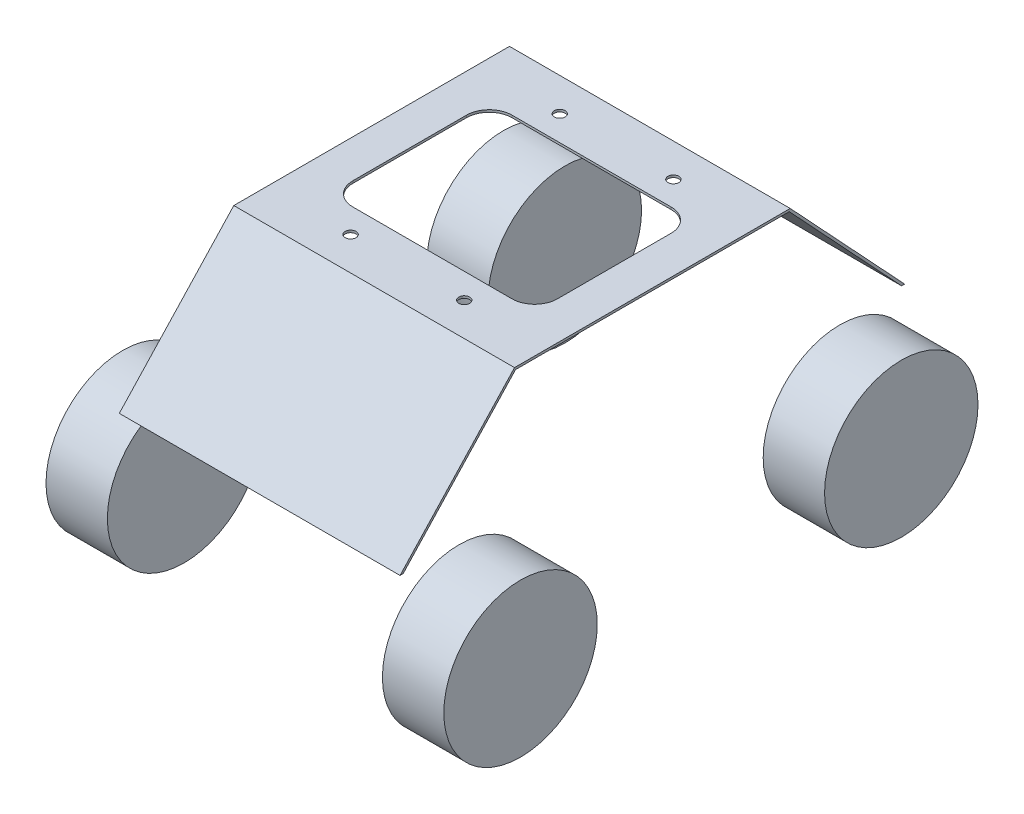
ISO-10303-21;
HEADER;
FILE_DESCRIPTION(('STEP AP214'),'2;1');
FILE_NAME('part.step','',(''),(''),'','','');
FILE_SCHEMA(('AUTOMOTIVE_DESIGN { 1 0 10303 214 1 1 1 1 }'));
ENDSEC;
DATA;
#1=APPLICATION_CONTEXT('core data for automotive mechanical design processes');
#2=APPLICATION_PROTOCOL_DEFINITION('international standard','automotive_design',2000,#1);
#3=PRODUCT_CONTEXT('',#1,'mechanical');
#4=PRODUCT('Part','Part','',(#3));
#5=PRODUCT_RELATED_PRODUCT_CATEGORY('part','',(#4));
#6=PRODUCT_DEFINITION_FORMATION('','',#4);
#7=PRODUCT_DEFINITION_CONTEXT('part definition',#1,'design');
#8=PRODUCT_DEFINITION('design','',#6,#7);
#9=PRODUCT_DEFINITION_SHAPE('','',#8);
#10=(LENGTH_UNIT() NAMED_UNIT(*) SI_UNIT(.MILLI.,.METRE.));
#11=(NAMED_UNIT(*) PLANE_ANGLE_UNIT() SI_UNIT($,.RADIAN.));
#12=(NAMED_UNIT(*) SI_UNIT($,.STERADIAN.) SOLID_ANGLE_UNIT());
#13=UNCERTAINTY_MEASURE_WITH_UNIT(LENGTH_MEASURE(1.E-05),#10,'distance_accuracy_value','');
#14=(GEOMETRIC_REPRESENTATION_CONTEXT(3) GLOBAL_UNCERTAINTY_ASSIGNED_CONTEXT((#13)) GLOBAL_UNIT_ASSIGNED_CONTEXT((#10,
#11,#12)) REPRESENTATION_CONTEXT('',''));
#15=CARTESIAN_POINT('',(0.,0.,0.));
#16=DIRECTION('',(0.,0.,1.));
#17=DIRECTION('',(1.,0.,0.));
#18=AXIS2_PLACEMENT_3D('',#15,#16,#17);
#19=CARTESIAN_POINT('',(0.,70.,0.));
#20=DIRECTION('',(0.,1.,0.));
#21=DIRECTION('',(0.,0.,1.));
#22=AXIS2_PLACEMENT_3D('',#19,#20,#21);
#23=PLANE('',#22);
#24=DIRECTION('',(0.,0.,1.));
#25=VECTOR('',#24,1.);
#26=CARTESIAN_POINT('',(-61.75,70.,-111.));
#27=LINE('',#26,#25);
#28=CARTESIAN_POINT('',(-61.75,70.,109.632672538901));
#29=VERTEX_POINT('',#28);
#30=CARTESIAN_POINT('',(-61.75,70.,111.));
#31=VERTEX_POINT('',#30);
#32=EDGE_CURVE('E254',#29,#31,#27,.T.);
#33=ORIENTED_EDGE('',*,*,#32,.F.);
#34=DIRECTION('',(1.,0.,0.));
#35=VECTOR('',#34,1.);
#36=CARTESIAN_POINT('',(0.,70.,109.632672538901));
#37=LINE('',#36,#35);
#38=CARTESIAN_POINT('',(61.75,70.,109.632672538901));
#39=VERTEX_POINT('',#38);
#40=EDGE_CURVE('E261',#29,#39,#37,.T.);
#41=ORIENTED_EDGE('',*,*,#40,.T.);
#42=DIRECTION('',(0.,0.,-1.));
#43=VECTOR('',#42,1.);
#44=CARTESIAN_POINT('',(61.75,70.,-111.));
#45=LINE('',#44,#43);
#46=CARTESIAN_POINT('',(61.75,70.,111.));
#47=VERTEX_POINT('',#46);
#48=EDGE_CURVE('E249',#47,#39,#45,.T.);
#49=ORIENTED_EDGE('',*,*,#48,.F.);
#50=DIRECTION('',(1.,0.,0.));
#51=VECTOR('',#50,1.);
#52=CARTESIAN_POINT('',(-61.75,70.,111.));
#53=LINE('',#52,#51);
#54=EDGE_CURVE('E246',#31,#47,#53,.T.);
#55=ORIENTED_EDGE('',*,*,#54,.F.);
#56=EDGE_LOOP('',(#33,#41,#49,#55));
#57=FACE_BOUND('',#56,.T.);
#58=ADVANCED_FACE('F43',(#57),#23,.F.);
#59=CARTESIAN_POINT('',(61.75,124.,-111.));
#60=DIRECTION('',(-1.,0.,0.));
#61=DIRECTION('',(0.,0.,1.));
#62=AXIS2_PLACEMENT_3D('',#59,#60,#61);
#63=PLANE('',#62);
#64=ORIENTED_EDGE('',*,*,#48,.T.);
#65=DIRECTION('',(0.,-0.731353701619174,0.681998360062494));
#66=VECTOR('',#65,1.);
#67=CARTESIAN_POINT('',(61.75,70.,109.632672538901));
#68=LINE('',#67,#66);
#69=CARTESIAN_POINT('',(61.75,123.,60.2093729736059));
#70=VERTEX_POINT('',#69);
#71=EDGE_CURVE('E213',#70,#39,#68,.T.);
#72=ORIENTED_EDGE('',*,*,#71,.F.);
#73=DIRECTION('',(0.,0.,1.));
#74=VECTOR('',#73,1.);
#75=CARTESIAN_POINT('',(61.75,123.,60.2093729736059));
#76=LINE('',#75,#74);
#77=CARTESIAN_POINT('',(61.75,123.,-60.2093729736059));
#78=VERTEX_POINT('',#77);
#79=EDGE_CURVE('E210',#78,#70,#76,.T.);
#80=ORIENTED_EDGE('',*,*,#79,.F.);
#81=DIRECTION('',(0.,0.731353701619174,0.681998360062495));
#82=VECTOR('',#81,1.);
#83=CARTESIAN_POINT('',(61.75,123.,-60.2093729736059));
#84=LINE('',#83,#82);
#85=CARTESIAN_POINT('',(61.75,70.,-109.632672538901));
#86=VERTEX_POINT('',#85);
#87=EDGE_CURVE('E197',#86,#78,#84,.T.);
#88=ORIENTED_EDGE('',*,*,#87,.F.);
#89=CARTESIAN_POINT('',(61.75,70.,-111.));
#90=VERTEX_POINT('',#89);
#91=EDGE_CURVE('E241',#86,#90,#45,.T.);
#92=ORIENTED_EDGE('',*,*,#91,.T.);
#93=DIRECTION('',(0.,-0.731353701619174,-0.681998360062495));
#94=VECTOR('',#93,1.);
#95=CARTESIAN_POINT('',(61.75,70.,-111.));
#96=LINE('',#95,#94);
#97=CARTESIAN_POINT('',(61.75,124.,-60.6441853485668));
#98=VERTEX_POINT('',#97);
#99=EDGE_CURVE('E225',#98,#90,#96,.T.);
#100=ORIENTED_EDGE('',*,*,#99,.F.);
#101=DIRECTION('',(0.,0.,-1.));
#102=VECTOR('',#101,1.);
#103=CARTESIAN_POINT('',(61.75,124.,-111.));
#104=LINE('',#103,#102);
#105=CARTESIAN_POINT('',(61.75,124.,60.6441853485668));
#106=VERTEX_POINT('',#105);
#107=EDGE_CURVE('E242',#106,#98,#104,.T.);
#108=ORIENTED_EDGE('',*,*,#107,.F.);
#109=DIRECTION('',(0.,0.731353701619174,-0.681998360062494));
#110=VECTOR('',#109,1.);
#111=CARTESIAN_POINT('',(61.75,124.,60.6441853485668));
#112=LINE('',#111,#110);
#113=EDGE_CURVE('E233',#47,#106,#112,.T.);
#114=ORIENTED_EDGE('',*,*,#113,.F.);
#115=EDGE_LOOP('',(#64,#72,#80,#88,#92,#100,#108,#114));
#116=FACE_BOUND('',#115,.T.);
#117=ADVANCED_FACE('F45',(#116),#63,.F.);
#118=CARTESIAN_POINT('',(-61.75,124.,-111.));
#119=DIRECTION('',(1.,0.,0.));
#120=DIRECTION('',(0.,0.,-1.));
#121=AXIS2_PLACEMENT_3D('',#118,#119,#120);
#122=PLANE('',#121);
#123=DIRECTION('',(0.,0.,1.));
#124=VECTOR('',#123,1.);
#125=CARTESIAN_POINT('',(-61.75,123.,-111.));
#126=LINE('',#125,#124);
#127=CARTESIAN_POINT('',(-61.75,123.,-60.2093729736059));
#128=VERTEX_POINT('',#127);
#129=CARTESIAN_POINT('',(-61.75,123.,60.2093729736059));
#130=VERTEX_POINT('',#129);
#131=EDGE_CURVE('E264',#128,#130,#126,.T.);
#132=ORIENTED_EDGE('',*,*,#131,.T.);
#133=DIRECTION('',(0.,-0.731353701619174,0.681998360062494));
#134=VECTOR('',#133,1.);
#135=CARTESIAN_POINT('',(-61.75,208.93103600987,-19.9226144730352));
#136=LINE('',#135,#134);
#137=EDGE_CURVE('E222',#130,#29,#136,.T.);
#138=ORIENTED_EDGE('',*,*,#137,.T.);
#139=ORIENTED_EDGE('',*,*,#32,.T.);
#140=DIRECTION('',(0.,0.731353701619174,-0.681998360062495));
#141=VECTOR('',#140,1.);
#142=CARTESIAN_POINT('',(-61.75,209.613034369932,-19.1912607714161));
#143=LINE('',#142,#141);
#144=CARTESIAN_POINT('',(-61.75,124.,60.6441853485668));
#145=VERTEX_POINT('',#144);
#146=EDGE_CURVE('E238',#31,#145,#143,.T.);
#147=ORIENTED_EDGE('',*,*,#146,.T.);
#148=DIRECTION('',(0.,0.,1.));
#149=VECTOR('',#148,1.);
#150=CARTESIAN_POINT('',(-61.75,124.,-111.));
#151=LINE('',#150,#149);
#152=CARTESIAN_POINT('',(-61.75,124.,-60.6441853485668));
#153=VERTEX_POINT('',#152);
#154=EDGE_CURVE('E245',#153,#145,#151,.T.);
#155=ORIENTED_EDGE('',*,*,#154,.F.);
#156=DIRECTION('',(0.,-0.731353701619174,-0.681998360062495));
#157=VECTOR('',#156,1.);
#158=CARTESIAN_POINT('',(-61.75,98.8834247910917,-84.0657706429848));
#159=LINE('',#158,#157);
#160=CARTESIAN_POINT('',(-61.75,70.,-111.));
#161=VERTEX_POINT('',#160);
#162=EDGE_CURVE('E230',#153,#161,#159,.T.);
#163=ORIENTED_EDGE('',*,*,#162,.T.);
#164=CARTESIAN_POINT('',(-61.75,70.,-109.632672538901));
#165=VERTEX_POINT('',#164);
#166=EDGE_CURVE('E255',#161,#165,#27,.T.);
#167=ORIENTED_EDGE('',*,*,#166,.T.);
#168=DIRECTION('',(0.,0.731353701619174,0.681998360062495));
#169=VECTOR('',#168,1.);
#170=CARTESIAN_POINT('',(-61.75,98.2014264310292,-83.3344169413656));
#171=LINE('',#170,#169);
#172=EDGE_CURVE('E218',#165,#128,#171,.T.);
#173=ORIENTED_EDGE('',*,*,#172,.T.);
#174=EDGE_LOOP('',(#132,#138,#139,#147,#155,#163,#167,#173));
#175=FACE_BOUND('',#174,.T.);
#176=ADVANCED_FACE('F314',(#175),#122,.F.);
#177=CARTESIAN_POINT('',(0.,124.,0.));
#178=DIRECTION('',(0.,1.,0.));
#179=DIRECTION('',(0.,0.,1.));
#180=AXIS2_PLACEMENT_3D('',#177,#178,#179);
#181=PLANE('',#180);
#182=CARTESIAN_POINT('',(25.,124.,-46.));
#183=DIRECTION('',(0.,1.,0.));
#184=DIRECTION('',(0.,0.,1.));
#185=AXIS2_PLACEMENT_3D('',#182,#183,#184);
#186=CIRCLE('',#185,2.4);
#187=CARTESIAN_POINT('',(25.,124.,-43.6));
#188=VERTEX_POINT('',#187);
#189=EDGE_CURVE('E303',#188,#188,#186,.T.);
#190=ORIENTED_EDGE('',*,*,#189,.F.);
#191=EDGE_LOOP('',(#190));
#192=FACE_BOUND('',#191,.T.);
#193=CARTESIAN_POINT('',(-25.,124.,-46.));
#194=DIRECTION('',(0.,1.,0.));
#195=DIRECTION('',(0.,0.,1.));
#196=AXIS2_PLACEMENT_3D('',#193,#194,#195);
#197=CIRCLE('',#196,2.4);
#198=CARTESIAN_POINT('',(-25.,124.,-43.6));
#199=VERTEX_POINT('',#198);
#200=EDGE_CURVE('E293',#199,#199,#197,.T.);
#201=ORIENTED_EDGE('',*,*,#200,.F.);
#202=EDGE_LOOP('',(#201));
#203=FACE_BOUND('',#202,.T.);
#204=CARTESIAN_POINT('',(25.,124.,46.));
#205=DIRECTION('',(0.,1.,0.));
#206=DIRECTION('',(0.,0.,1.));
#207=AXIS2_PLACEMENT_3D('',#204,#205,#206);
#208=CIRCLE('',#207,2.4);
#209=CARTESIAN_POINT('',(25.,124.,48.4));
#210=VERTEX_POINT('',#209);
#211=EDGE_CURVE('E290',#210,#210,#208,.T.);
#212=ORIENTED_EDGE('',*,*,#211,.F.);
#213=EDGE_LOOP('',(#212));
#214=FACE_BOUND('',#213,.T.);
#215=CARTESIAN_POINT('',(-25.,124.,46.));
#216=DIRECTION('',(0.,1.,0.));
#217=DIRECTION('',(0.,0.,1.));
#218=AXIS2_PLACEMENT_3D('',#215,#216,#217);
#219=CIRCLE('',#218,2.4);
#220=CARTESIAN_POINT('',(-25.,124.,48.4));
#221=VERTEX_POINT('',#220);
#222=EDGE_CURVE('E287',#221,#221,#219,.T.);
#223=ORIENTED_EDGE('',*,*,#222,.F.);
#224=EDGE_LOOP('',(#223));
#225=FACE_BOUND('',#224,.T.);
#226=CARTESIAN_POINT('',(35.,124.,25.));
#227=DIRECTION('',(0.,1.,0.));
#228=DIRECTION('',(0.,0.,1.));
#229=AXIS2_PLACEMENT_3D('',#226,#227,#228);
#230=CIRCLE('',#229,10.);
#231=CARTESIAN_POINT('',(34.9999999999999,124.,35.));
#232=VERTEX_POINT('',#231);
#233=CARTESIAN_POINT('',(45.,124.,24.9999999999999));
#234=VERTEX_POINT('',#233);
#235=EDGE_CURVE('E60',#232,#234,#230,.T.);
#236=ORIENTED_EDGE('',*,*,#235,.F.);
#237=DIRECTION('',(1.,0.,0.));
#238=VECTOR('',#237,1.);
#239=CARTESIAN_POINT('',(-34.9999999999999,124.,35.));
#240=LINE('',#239,#238);
#241=CARTESIAN_POINT('',(-34.9999999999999,124.,35.));
#242=VERTEX_POINT('',#241);
#243=EDGE_CURVE('E192',#242,#232,#240,.T.);
#244=ORIENTED_EDGE('',*,*,#243,.F.);
#245=CARTESIAN_POINT('',(-35.,124.,25.));
#246=DIRECTION('',(0.,1.,0.));
#247=DIRECTION('',(0.,0.,1.));
#248=AXIS2_PLACEMENT_3D('',#245,#246,#247);
#249=CIRCLE('',#248,10.);
#250=CARTESIAN_POINT('',(-45.,124.,24.9999999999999));
#251=VERTEX_POINT('',#250);
#252=EDGE_CURVE('E189',#251,#242,#249,.T.);
#253=ORIENTED_EDGE('',*,*,#252,.F.);
#254=DIRECTION('',(0.,0.,1.));
#255=VECTOR('',#254,1.);
#256=CARTESIAN_POINT('',(-45.,124.,-24.9999999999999));
#257=LINE('',#256,#255);
#258=CARTESIAN_POINT('',(-45.,124.,-24.9999999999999));
#259=VERTEX_POINT('',#258);
#260=EDGE_CURVE('E186',#259,#251,#257,.T.);
#261=ORIENTED_EDGE('',*,*,#260,.F.);
#262=CARTESIAN_POINT('',(-35.,124.,-25.));
#263=DIRECTION('',(0.,1.,0.));
#264=DIRECTION('',(0.,0.,1.));
#265=AXIS2_PLACEMENT_3D('',#262,#263,#264);
#266=CIRCLE('',#265,10.);
#267=CARTESIAN_POINT('',(-34.9999999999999,124.,-35.));
#268=VERTEX_POINT('',#267);
#269=EDGE_CURVE('E180',#268,#259,#266,.T.);
#270=ORIENTED_EDGE('',*,*,#269,.F.);
#271=DIRECTION('',(-1.,0.,0.));
#272=VECTOR('',#271,1.);
#273=CARTESIAN_POINT('',(-34.9999999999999,124.,-35.));
#274=LINE('',#273,#272);
#275=CARTESIAN_POINT('',(34.9999999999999,124.,-35.));
#276=VERTEX_POINT('',#275);
#277=EDGE_CURVE('E178',#276,#268,#274,.T.);
#278=ORIENTED_EDGE('',*,*,#277,.F.);
#279=CARTESIAN_POINT('',(35.,124.,-25.));
#280=DIRECTION('',(0.,1.,0.));
#281=DIRECTION('',(0.,0.,-1.));
#282=AXIS2_PLACEMENT_3D('',#279,#280,#281);
#283=CIRCLE('',#282,10.);
#284=CARTESIAN_POINT('',(45.,124.,-24.9999999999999));
#285=VERTEX_POINT('',#284);
#286=EDGE_CURVE('E161',#285,#276,#283,.T.);
#287=ORIENTED_EDGE('',*,*,#286,.F.);
#288=DIRECTION('',(0.,0.,-1.));
#289=VECTOR('',#288,1.);
#290=CARTESIAN_POINT('',(45.,124.,-24.9999999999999));
#291=LINE('',#290,#289);
#292=EDGE_CURVE('E170',#234,#285,#291,.T.);
#293=ORIENTED_EDGE('',*,*,#292,.F.);
#294=EDGE_LOOP('',(#236,#244,#253,#261,#270,#278,#287,#293));
#295=FACE_BOUND('',#294,.T.);
#296=DIRECTION('',(1.,0.,0.));
#297=VECTOR('',#296,1.);
#298=CARTESIAN_POINT('',(-87.5,124.,-60.6441853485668));
#299=LINE('',#298,#297);
#300=EDGE_CURVE('E228',#153,#98,#299,.T.);
#301=ORIENTED_EDGE('',*,*,#300,.F.);
#302=ORIENTED_EDGE('',*,*,#154,.T.);
#303=DIRECTION('',(1.,0.,0.));
#304=VECTOR('',#303,1.);
#305=CARTESIAN_POINT('',(-87.5,124.,60.6441853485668));
#306=LINE('',#305,#304);
#307=EDGE_CURVE('E235',#145,#106,#306,.T.);
#308=ORIENTED_EDGE('',*,*,#307,.T.);
#309=ORIENTED_EDGE('',*,*,#107,.T.);
#310=EDGE_LOOP('',(#301,#302,#308,#309));
#311=FACE_BOUND('',#310,.T.);
#312=ADVANCED_FACE('F174',(#192,#203,#214,#225,#295,#311),#181,.T.);
#313=ORIENTED_EDGE('',*,*,#91,.F.);
#314=DIRECTION('',(-1.,0.,0.));
#315=VECTOR('',#314,1.);
#316=CARTESIAN_POINT('',(0.,70.,-109.632672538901));
#317=LINE('',#316,#315);
#318=EDGE_CURVE('E248',#86,#165,#317,.T.);
#319=ORIENTED_EDGE('',*,*,#318,.T.);
#320=ORIENTED_EDGE('',*,*,#166,.F.);
#321=DIRECTION('',(-1.,0.,0.));
#322=VECTOR('',#321,1.);
#323=CARTESIAN_POINT('',(-61.75,70.,-111.));
#324=LINE('',#323,#322);
#325=EDGE_CURVE('E252',#90,#161,#324,.T.);
#326=ORIENTED_EDGE('',*,*,#325,.F.);
#327=EDGE_LOOP('',(#313,#319,#320,#326));
#328=FACE_BOUND('',#327,.T.);
#329=ADVANCED_FACE('F313',(#328),#23,.F.);
#330=CARTESIAN_POINT('',(-87.5,124.,60.6441853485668));
#331=DIRECTION('',(0.,-0.681998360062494,-0.731353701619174));
#332=DIRECTION('',(0.,0.731353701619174,-0.681998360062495));
#333=AXIS2_PLACEMENT_3D('',#330,#331,#332);
#334=PLANE('',#333);
#335=ORIENTED_EDGE('',*,*,#54,.T.);
#336=ORIENTED_EDGE('',*,*,#113,.T.);
#337=ORIENTED_EDGE('',*,*,#307,.F.);
#338=ORIENTED_EDGE('',*,*,#146,.F.);
#339=EDGE_LOOP('',(#335,#336,#337,#338));
#340=FACE_BOUND('',#339,.T.);
#341=ADVANCED_FACE('F321',(#340),#334,.F.);
#342=CARTESIAN_POINT('',(-87.5,70.,-111.));
#343=DIRECTION('',(0.,-0.681998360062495,0.731353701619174));
#344=DIRECTION('',(0.,-0.731353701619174,-0.681998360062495));
#345=AXIS2_PLACEMENT_3D('',#342,#343,#344);
#346=PLANE('',#345);
#347=ORIENTED_EDGE('',*,*,#300,.T.);
#348=ORIENTED_EDGE('',*,*,#99,.T.);
#349=ORIENTED_EDGE('',*,*,#325,.T.);
#350=ORIENTED_EDGE('',*,*,#162,.F.);
#351=EDGE_LOOP('',(#347,#348,#349,#350));
#352=FACE_BOUND('',#351,.T.);
#353=ADVANCED_FACE('F349',(#352),#346,.F.);
#354=CARTESIAN_POINT('',(-87.5,123.,60.2093729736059));
#355=DIRECTION('',(0.,1.,0.));
#356=DIRECTION('',(0.,0.,1.));
#357=AXIS2_PLACEMENT_3D('',#354,#355,#356);
#358=PLANE('',#357);
#359=CARTESIAN_POINT('',(25.,123.,-46.));
#360=DIRECTION('',(0.,1.,0.));
#361=DIRECTION('',(0.,0.,1.));
#362=AXIS2_PLACEMENT_3D('',#359,#360,#361);
#363=CIRCLE('',#362,2.4);
#364=CARTESIAN_POINT('',(25.,123.,-43.6));
#365=VERTEX_POINT('',#364);
#366=EDGE_CURVE('E47',#365,#365,#363,.T.);
#367=ORIENTED_EDGE('',*,*,#366,.T.);
#368=EDGE_LOOP('',(#367));
#369=FACE_BOUND('',#368,.T.);
#370=CARTESIAN_POINT('',(-25.,123.,-46.));
#371=DIRECTION('',(0.,1.,0.));
#372=DIRECTION('',(0.,0.,1.));
#373=AXIS2_PLACEMENT_3D('',#370,#371,#372);
#374=CIRCLE('',#373,2.4);
#375=CARTESIAN_POINT('',(-25.,123.,-43.6));
#376=VERTEX_POINT('',#375);
#377=EDGE_CURVE('E291',#376,#376,#374,.T.);
#378=ORIENTED_EDGE('',*,*,#377,.T.);
#379=EDGE_LOOP('',(#378));
#380=FACE_BOUND('',#379,.T.);
#381=CARTESIAN_POINT('',(25.,123.,46.));
#382=DIRECTION('',(0.,1.,0.));
#383=DIRECTION('',(0.,0.,1.));
#384=AXIS2_PLACEMENT_3D('',#381,#382,#383);
#385=CIRCLE('',#384,2.4);
#386=CARTESIAN_POINT('',(25.,123.,48.4));
#387=VERTEX_POINT('',#386);
#388=EDGE_CURVE('E288',#387,#387,#385,.T.);
#389=ORIENTED_EDGE('',*,*,#388,.T.);
#390=EDGE_LOOP('',(#389));
#391=FACE_BOUND('',#390,.T.);
#392=CARTESIAN_POINT('',(-25.,123.,46.));
#393=DIRECTION('',(0.,1.,0.));
#394=DIRECTION('',(0.,0.,1.));
#395=AXIS2_PLACEMENT_3D('',#392,#393,#394);
#396=CIRCLE('',#395,2.4);
#397=CARTESIAN_POINT('',(-25.,123.,48.4));
#398=VERTEX_POINT('',#397);
#399=EDGE_CURVE('E284',#398,#398,#396,.T.);
#400=ORIENTED_EDGE('',*,*,#399,.T.);
#401=EDGE_LOOP('',(#400));
#402=FACE_BOUND('',#401,.T.);
#403=DIRECTION('',(1.,0.,0.));
#404=VECTOR('',#403,1.);
#405=CARTESIAN_POINT('',(-87.5,123.,35.));
#406=LINE('',#405,#404);
#407=CARTESIAN_POINT('',(-34.9999999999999,123.,35.));
#408=VERTEX_POINT('',#407);
#409=CARTESIAN_POINT('',(34.9999999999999,123.,35.));
#410=VERTEX_POINT('',#409);
#411=EDGE_CURVE('E52',#408,#410,#406,.T.);
#412=ORIENTED_EDGE('',*,*,#411,.T.);
#413=CARTESIAN_POINT('',(35.,123.,25.));
#414=DIRECTION('',(0.,1.,0.));
#415=DIRECTION('',(0.,0.,1.));
#416=AXIS2_PLACEMENT_3D('',#413,#414,#415);
#417=CIRCLE('',#416,10.);
#418=CARTESIAN_POINT('',(45.,123.,24.9999999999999));
#419=VERTEX_POINT('',#418);
#420=EDGE_CURVE('E12',#410,#419,#417,.T.);
#421=ORIENTED_EDGE('',*,*,#420,.T.);
#422=DIRECTION('',(0.,0.,-1.));
#423=VECTOR('',#422,1.);
#424=CARTESIAN_POINT('',(45.,123.,60.2093729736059));
#425=LINE('',#424,#423);
#426=CARTESIAN_POINT('',(45.,123.,-24.9999999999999));
#427=VERTEX_POINT('',#426);
#428=EDGE_CURVE('E267',#419,#427,#425,.T.);
#429=ORIENTED_EDGE('',*,*,#428,.T.);
#430=CARTESIAN_POINT('',(35.,123.,-25.));
#431=DIRECTION('',(0.,1.,0.));
#432=DIRECTION('',(0.,0.,1.));
#433=AXIS2_PLACEMENT_3D('',#430,#431,#432);
#434=CIRCLE('',#433,10.);
#435=CARTESIAN_POINT('',(34.9999999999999,123.,-35.));
#436=VERTEX_POINT('',#435);
#437=EDGE_CURVE('E164',#427,#436,#434,.T.);
#438=ORIENTED_EDGE('',*,*,#437,.T.);
#439=DIRECTION('',(-1.,0.,0.));
#440=VECTOR('',#439,1.);
#441=CARTESIAN_POINT('',(-87.5,123.,-35.));
#442=LINE('',#441,#440);
#443=CARTESIAN_POINT('',(-34.9999999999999,123.,-35.));
#444=VERTEX_POINT('',#443);
#445=EDGE_CURVE('E270',#436,#444,#442,.T.);
#446=ORIENTED_EDGE('',*,*,#445,.T.);
#447=CARTESIAN_POINT('',(-35.,123.,-25.));
#448=DIRECTION('',(0.,1.,0.));
#449=DIRECTION('',(0.,0.,1.));
#450=AXIS2_PLACEMENT_3D('',#447,#448,#449);
#451=CIRCLE('',#450,10.);
#452=CARTESIAN_POINT('',(-45.,123.,-24.9999999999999));
#453=VERTEX_POINT('',#452);
#454=EDGE_CURVE('E273',#444,#453,#451,.T.);
#455=ORIENTED_EDGE('',*,*,#454,.T.);
#456=DIRECTION('',(0.,0.,1.));
#457=VECTOR('',#456,1.);
#458=CARTESIAN_POINT('',(-45.,123.,60.2093729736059));
#459=LINE('',#458,#457);
#460=CARTESIAN_POINT('',(-45.,123.,24.9999999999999));
#461=VERTEX_POINT('',#460);
#462=EDGE_CURVE('E276',#453,#461,#459,.T.);
#463=ORIENTED_EDGE('',*,*,#462,.T.);
#464=CARTESIAN_POINT('',(-35.,123.,25.));
#465=DIRECTION('',(0.,1.,0.));
#466=DIRECTION('',(0.,0.,1.));
#467=AXIS2_PLACEMENT_3D('',#464,#465,#466);
#468=CIRCLE('',#467,10.);
#469=EDGE_CURVE('E279',#461,#408,#468,.T.);
#470=ORIENTED_EDGE('',*,*,#469,.T.);
#471=EDGE_LOOP('',(#412,#421,#429,#438,#446,#455,#463,#470));
#472=FACE_BOUND('',#471,.T.);
#473=DIRECTION('',(1.,0.,0.));
#474=VECTOR('',#473,1.);
#475=CARTESIAN_POINT('',(-87.5,123.,-60.2093729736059));
#476=LINE('',#475,#474);
#477=EDGE_CURVE('E215',#128,#78,#476,.T.);
#478=ORIENTED_EDGE('',*,*,#477,.T.);
#479=ORIENTED_EDGE('',*,*,#79,.T.);
#480=DIRECTION('',(1.,0.,0.));
#481=VECTOR('',#480,1.);
#482=CARTESIAN_POINT('',(-87.5,123.,60.2093729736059));
#483=LINE('',#482,#481);
#484=EDGE_CURVE('E216',#130,#70,#483,.T.);
#485=ORIENTED_EDGE('',*,*,#484,.F.);
#486=ORIENTED_EDGE('',*,*,#131,.F.);
#487=EDGE_LOOP('',(#478,#479,#485,#486));
#488=FACE_BOUND('',#487,.T.);
#489=ADVANCED_FACE('F356',(#369,#380,#391,#402,#472,#488),#358,.F.);
#490=CARTESIAN_POINT('',(-87.5,70.,109.632672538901));
#491=DIRECTION('',(0.,0.681998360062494,0.731353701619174));
#492=DIRECTION('',(0.,-0.731353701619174,0.681998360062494));
#493=AXIS2_PLACEMENT_3D('',#490,#491,#492);
#494=PLANE('',#493);
#495=ORIENTED_EDGE('',*,*,#484,.T.);
#496=ORIENTED_EDGE('',*,*,#71,.T.);
#497=ORIENTED_EDGE('',*,*,#40,.F.);
#498=ORIENTED_EDGE('',*,*,#137,.F.);
#499=EDGE_LOOP('',(#495,#496,#497,#498));
#500=FACE_BOUND('',#499,.T.);
#501=ADVANCED_FACE('F360',(#500),#494,.F.);
#502=CARTESIAN_POINT('',(-87.5,123.,-60.2093729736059));
#503=DIRECTION('',(0.,0.681998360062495,-0.731353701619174));
#504=DIRECTION('',(0.,0.731353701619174,0.681998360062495));
#505=AXIS2_PLACEMENT_3D('',#502,#503,#504);
#506=PLANE('',#505);
#507=ORIENTED_EDGE('',*,*,#318,.F.);
#508=ORIENTED_EDGE('',*,*,#87,.T.);
#509=ORIENTED_EDGE('',*,*,#477,.F.);
#510=ORIENTED_EDGE('',*,*,#172,.F.);
#511=EDGE_LOOP('',(#507,#508,#509,#510));
#512=FACE_BOUND('',#511,.T.);
#513=ADVANCED_FACE('F353',(#512),#506,.F.);
#514=CARTESIAN_POINT('',(35.,0.,25.));
#515=DIRECTION('',(0.,1.,0.));
#516=DIRECTION('',(0.,0.,1.));
#517=AXIS2_PLACEMENT_3D('',#514,#515,#516);
#518=CYLINDRICAL_SURFACE('',#517,10.);
#519=DIRECTION('',(0.,1.,0.));
#520=VECTOR('',#519,1.);
#521=CARTESIAN_POINT('',(34.9999999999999,0.,35.));
#522=LINE('',#521,#520);
#523=EDGE_CURVE('E195',#410,#232,#522,.T.);
#524=ORIENTED_EDGE('',*,*,#523,.T.);
#525=ORIENTED_EDGE('',*,*,#235,.T.);
#526=DIRECTION('',(0.,1.,0.));
#527=VECTOR('',#526,1.);
#528=CARTESIAN_POINT('',(45.,0.,24.9999999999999));
#529=LINE('',#528,#527);
#530=EDGE_CURVE('E167',#419,#234,#529,.T.);
#531=ORIENTED_EDGE('',*,*,#530,.F.);
#532=ORIENTED_EDGE('',*,*,#420,.F.);
#533=EDGE_LOOP('',(#524,#525,#531,#532));
#534=FACE_BOUND('',#533,.T.);
#535=ADVANCED_FACE('F367',(#534),#518,.F.);
#536=CARTESIAN_POINT('',(-34.9999999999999,0.,35.));
#537=DIRECTION('',(0.,0.,1.));
#538=DIRECTION('',(1.,0.,0.));
#539=AXIS2_PLACEMENT_3D('',#536,#537,#538);
#540=PLANE('',#539);
#541=DIRECTION('',(0.,1.,0.));
#542=VECTOR('',#541,1.);
#543=CARTESIAN_POINT('',(-34.9999999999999,0.,35.));
#544=LINE('',#543,#542);
#545=EDGE_CURVE('E198',#408,#242,#544,.T.);
#546=ORIENTED_EDGE('',*,*,#545,.T.);
#547=ORIENTED_EDGE('',*,*,#243,.T.);
#548=ORIENTED_EDGE('',*,*,#523,.F.);
#549=ORIENTED_EDGE('',*,*,#411,.F.);
#550=EDGE_LOOP('',(#546,#547,#548,#549));
#551=FACE_BOUND('',#550,.T.);
#552=ADVANCED_FACE('F401',(#551),#540,.F.);
#553=CARTESIAN_POINT('',(-35.,0.,25.));
#554=DIRECTION('',(0.,1.,0.));
#555=DIRECTION('',(0.,0.,1.));
#556=AXIS2_PLACEMENT_3D('',#553,#554,#555);
#557=CYLINDRICAL_SURFACE('',#556,10.);
#558=DIRECTION('',(0.,1.,0.));
#559=VECTOR('',#558,1.);
#560=CARTESIAN_POINT('',(-45.,0.,24.9999999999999));
#561=LINE('',#560,#559);
#562=EDGE_CURVE('E200',#461,#251,#561,.T.);
#563=ORIENTED_EDGE('',*,*,#562,.T.);
#564=ORIENTED_EDGE('',*,*,#252,.T.);
#565=ORIENTED_EDGE('',*,*,#545,.F.);
#566=ORIENTED_EDGE('',*,*,#469,.F.);
#567=EDGE_LOOP('',(#563,#564,#565,#566));
#568=FACE_BOUND('',#567,.T.);
#569=ADVANCED_FACE('F410',(#568),#557,.F.);
#570=CARTESIAN_POINT('',(-45.,0.,-24.9999999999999));
#571=DIRECTION('',(-1.,0.,0.));
#572=DIRECTION('',(0.,0.,1.));
#573=AXIS2_PLACEMENT_3D('',#570,#571,#572);
#574=PLANE('',#573);
#575=DIRECTION('',(0.,1.,0.));
#576=VECTOR('',#575,1.);
#577=CARTESIAN_POINT('',(-45.,0.,-24.9999999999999));
#578=LINE('',#577,#576);
#579=EDGE_CURVE('E202',#453,#259,#578,.T.);
#580=ORIENTED_EDGE('',*,*,#579,.T.);
#581=ORIENTED_EDGE('',*,*,#260,.T.);
#582=ORIENTED_EDGE('',*,*,#562,.F.);
#583=ORIENTED_EDGE('',*,*,#462,.F.);
#584=EDGE_LOOP('',(#580,#581,#582,#583));
#585=FACE_BOUND('',#584,.T.);
#586=ADVANCED_FACE('F420',(#585),#574,.F.);
#587=CARTESIAN_POINT('',(-35.,0.,-25.));
#588=DIRECTION('',(0.,1.,0.));
#589=DIRECTION('',(0.,0.,1.));
#590=AXIS2_PLACEMENT_3D('',#587,#588,#589);
#591=CYLINDRICAL_SURFACE('',#590,10.);
#592=DIRECTION('',(0.,1.,0.));
#593=VECTOR('',#592,1.);
#594=CARTESIAN_POINT('',(-34.9999999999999,0.,-35.));
#595=LINE('',#594,#593);
#596=EDGE_CURVE('E204',#444,#268,#595,.T.);
#597=ORIENTED_EDGE('',*,*,#596,.T.);
#598=ORIENTED_EDGE('',*,*,#269,.T.);
#599=ORIENTED_EDGE('',*,*,#579,.F.);
#600=ORIENTED_EDGE('',*,*,#454,.F.);
#601=EDGE_LOOP('',(#597,#598,#599,#600));
#602=FACE_BOUND('',#601,.T.);
#603=ADVANCED_FACE('F430',(#602),#591,.F.);
#604=CARTESIAN_POINT('',(-34.9999999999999,0.,-35.));
#605=DIRECTION('',(0.,0.,-1.));
#606=DIRECTION('',(-1.,0.,0.));
#607=AXIS2_PLACEMENT_3D('',#604,#605,#606);
#608=PLANE('',#607);
#609=DIRECTION('',(0.,1.,0.));
#610=VECTOR('',#609,1.);
#611=CARTESIAN_POINT('',(34.9999999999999,0.,-35.));
#612=LINE('',#611,#610);
#613=EDGE_CURVE('E166',#436,#276,#612,.T.);
#614=ORIENTED_EDGE('',*,*,#613,.T.);
#615=ORIENTED_EDGE('',*,*,#277,.T.);
#616=ORIENTED_EDGE('',*,*,#596,.F.);
#617=ORIENTED_EDGE('',*,*,#445,.F.);
#618=EDGE_LOOP('',(#614,#615,#616,#617));
#619=FACE_BOUND('',#618,.T.);
#620=ADVANCED_FACE('F440',(#619),#608,.F.);
#621=CARTESIAN_POINT('',(35.,0.,-25.));
#622=DIRECTION('',(0.,1.,0.));
#623=DIRECTION('',(0.,0.,1.));
#624=AXIS2_PLACEMENT_3D('',#621,#622,#623);
#625=CYLINDRICAL_SURFACE('',#624,10.);
#626=DIRECTION('',(0.,1.,0.));
#627=VECTOR('',#626,1.);
#628=CARTESIAN_POINT('',(45.,0.,-24.9999999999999));
#629=LINE('',#628,#627);
#630=EDGE_CURVE('E68',#427,#285,#629,.T.);
#631=ORIENTED_EDGE('',*,*,#630,.T.);
#632=ORIENTED_EDGE('',*,*,#286,.T.);
#633=ORIENTED_EDGE('',*,*,#613,.F.);
#634=ORIENTED_EDGE('',*,*,#437,.F.);
#635=EDGE_LOOP('',(#631,#632,#633,#634));
#636=FACE_BOUND('',#635,.T.);
#637=ADVANCED_FACE('F158',(#636),#625,.F.);
#638=CARTESIAN_POINT('',(45.,0.,-24.9999999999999));
#639=DIRECTION('',(1.,0.,0.));
#640=DIRECTION('',(0.,0.,-1.));
#641=AXIS2_PLACEMENT_3D('',#638,#639,#640);
#642=PLANE('',#641);
#643=ORIENTED_EDGE('',*,*,#530,.T.);
#644=ORIENTED_EDGE('',*,*,#292,.T.);
#645=ORIENTED_EDGE('',*,*,#630,.F.);
#646=ORIENTED_EDGE('',*,*,#428,.F.);
#647=EDGE_LOOP('',(#643,#644,#645,#646));
#648=FACE_BOUND('',#647,.T.);
#649=ADVANCED_FACE('F171',(#648),#642,.F.);
#650=CARTESIAN_POINT('',(-25.,0.,46.));
#651=DIRECTION('',(0.,1.,0.));
#652=DIRECTION('',(0.,0.,1.));
#653=AXIS2_PLACEMENT_3D('',#650,#651,#652);
#654=CYLINDRICAL_SURFACE('',#653,2.4);
#655=ORIENTED_EDGE('',*,*,#222,.T.);
#656=EDGE_LOOP('',(#655));
#657=FACE_BOUND('',#656,.T.);
#658=ORIENTED_EDGE('',*,*,#399,.F.);
#659=EDGE_LOOP('',(#658));
#660=FACE_BOUND('',#659,.T.);
#661=ADVANCED_FACE('F309',(#657,#660),#654,.F.);
#662=CARTESIAN_POINT('',(25.,0.,46.));
#663=DIRECTION('',(0.,1.,0.));
#664=DIRECTION('',(0.,0.,1.));
#665=AXIS2_PLACEMENT_3D('',#662,#663,#664);
#666=CYLINDRICAL_SURFACE('',#665,2.4);
#667=ORIENTED_EDGE('',*,*,#211,.T.);
#668=EDGE_LOOP('',(#667));
#669=FACE_BOUND('',#668,.T.);
#670=ORIENTED_EDGE('',*,*,#388,.F.);
#671=EDGE_LOOP('',(#670));
#672=FACE_BOUND('',#671,.T.);
#673=ADVANCED_FACE('F474',(#669,#672),#666,.F.);
#674=CARTESIAN_POINT('',(-25.,0.,-46.));
#675=DIRECTION('',(0.,1.,0.));
#676=DIRECTION('',(0.,0.,1.));
#677=AXIS2_PLACEMENT_3D('',#674,#675,#676);
#678=CYLINDRICAL_SURFACE('',#677,2.4);
#679=ORIENTED_EDGE('',*,*,#200,.T.);
#680=EDGE_LOOP('',(#679));
#681=FACE_BOUND('',#680,.T.);
#682=ORIENTED_EDGE('',*,*,#377,.F.);
#683=EDGE_LOOP('',(#682));
#684=FACE_BOUND('',#683,.T.);
#685=ADVANCED_FACE('F483',(#681,#684),#678,.F.);
#686=CARTESIAN_POINT('',(25.,0.,-46.));
#687=DIRECTION('',(0.,1.,0.));
#688=DIRECTION('',(0.,0.,1.));
#689=AXIS2_PLACEMENT_3D('',#686,#687,#688);
#690=CYLINDRICAL_SURFACE('',#689,2.4);
#691=ORIENTED_EDGE('',*,*,#189,.T.);
#692=EDGE_LOOP('',(#691));
#693=FACE_BOUND('',#692,.T.);
#694=ORIENTED_EDGE('',*,*,#366,.F.);
#695=EDGE_LOOP('',(#694));
#696=FACE_BOUND('',#695,.T.);
#697=ADVANCED_FACE('F493',(#693,#696),#690,.F.);
#698=CLOSED_SHELL('',(#58,#117,#176,#312,#329,#341,#353,#489,#501,#513,#535,#552,#569,#586,#603,
#620,#637,#649,#661,#673,#685,#697));
#699=MANIFOLD_SOLID_BREP('B2',#698);
#700=CARTESIAN_POINT('',(87.5,67.5,-117.5));
#701=DIRECTION('',(-1.,0.,0.));
#702=DIRECTION('',(0.,0.,1.));
#703=AXIS2_PLACEMENT_3D('',#700,#701,#702);
#704=PLANE('',#703);
#705=CARTESIAN_POINT('',(87.5,33.75,83.75));
#706=DIRECTION('',(-1.,0.,0.));
#707=DIRECTION('',(0.,0.,1.));
#708=AXIS2_PLACEMENT_3D('',#705,#706,#707);
#709=CIRCLE('',#708,33.75);
#710=CARTESIAN_POINT('',(87.5,33.75,117.5));
#711=VERTEX_POINT('',#710);
#712=EDGE_CURVE('E589',#711,#711,#709,.F.);
#713=ORIENTED_EDGE('',*,*,#712,.T.);
#714=EDGE_LOOP('',(#713));
#715=FACE_BOUND('',#714,.T.);
#716=ADVANCED_FACE('F571',(#715),#704,.F.);
#717=CARTESIAN_POINT('',(0.,33.75,83.75));
#718=DIRECTION('',(-1.,0.,0.));
#719=DIRECTION('',(0.,0.,1.));
#720=AXIS2_PLACEMENT_3D('',#717,#718,#719);
#721=CYLINDRICAL_SURFACE('',#720,33.75);
#722=CARTESIAN_POINT('',(60.5,33.75,83.75));
#723=DIRECTION('',(1.,0.,0.));
#724=DIRECTION('',(0.,0.,-1.));
#725=AXIS2_PLACEMENT_3D('',#722,#723,#724);
#726=CIRCLE('',#725,33.75);
#727=CARTESIAN_POINT('',(60.5,33.75,117.5));
#728=VERTEX_POINT('',#727);
#729=EDGE_CURVE('E41',#728,#728,#726,.F.);
#730=ORIENTED_EDGE('',*,*,#729,.F.);
#731=DIRECTION('',(1.,0.,0.));
#732=VECTOR('',#731,1.);
#733=CARTESIAN_POINT('',(-87.5,33.75,117.5));
#734=LINE('',#733,#732);
#735=EDGE_CURVE('E575',#711,#728,#734,.F.);
#736=ORIENTED_EDGE('',*,*,#735,.F.);
#737=ORIENTED_EDGE('',*,*,#712,.F.);
#738=ORIENTED_EDGE('',*,*,#735,.T.);
#739=EDGE_LOOP('',(#730,#736,#737,#738));
#740=FACE_BOUND('',#739,.T.);
#741=ADVANCED_FACE('F573',(#740),#721,.T.);
#742=CARTESIAN_POINT('',(60.5,67.5,-117.5));
#743=DIRECTION('',(1.,0.,0.));
#744=DIRECTION('',(0.,0.,-1.));
#745=AXIS2_PLACEMENT_3D('',#742,#743,#744);
#746=PLANE('',#745);
#747=ORIENTED_EDGE('',*,*,#729,.T.);
#748=EDGE_LOOP('',(#747));
#749=FACE_BOUND('',#748,.T.);
#750=ADVANCED_FACE('F591',(#749),#746,.F.);
#751=CLOSED_SHELL('',(#716,#741,#750));
#752=MANIFOLD_SOLID_BREP('B6',#751);
#753=CARTESIAN_POINT('',(0.,33.75,-83.75));
#754=DIRECTION('',(1.,0.,0.));
#755=DIRECTION('',(0.,0.,-1.));
#756=AXIS2_PLACEMENT_3D('',#753,#754,#755);
#757=CYLINDRICAL_SURFACE('',#756,33.75);
#758=DIRECTION('',(-1.,0.,0.));
#759=VECTOR('',#758,1.);
#760=CARTESIAN_POINT('',(87.5,33.75,-117.5));
#761=LINE('',#760,#759);
#762=CARTESIAN_POINT('',(60.5,33.75,-117.5));
#763=VERTEX_POINT('',#762);
#764=CARTESIAN_POINT('',(87.5,33.75,-117.5));
#765=VERTEX_POINT('',#764);
#766=EDGE_CURVE('E635',#763,#765,#761,.F.);
#767=ORIENTED_EDGE('',*,*,#766,.F.);
#768=CARTESIAN_POINT('',(60.5,33.75,-83.75));
#769=DIRECTION('',(1.,0.,0.));
#770=DIRECTION('',(0.,0.,-1.));
#771=AXIS2_PLACEMENT_3D('',#768,#769,#770);
#772=CIRCLE('',#771,33.75);
#773=EDGE_CURVE('E569',#763,#763,#772,.F.);
#774=ORIENTED_EDGE('',*,*,#773,.F.);
#775=ORIENTED_EDGE('',*,*,#766,.T.);
#776=CARTESIAN_POINT('',(87.5,33.75,-83.75));
#777=DIRECTION('',(-1.,0.,0.));
#778=DIRECTION('',(0.,0.,1.));
#779=AXIS2_PLACEMENT_3D('',#776,#777,#778);
#780=CIRCLE('',#779,33.75);
#781=EDGE_CURVE('E640',#765,#765,#780,.F.);
#782=ORIENTED_EDGE('',*,*,#781,.F.);
#783=EDGE_LOOP('',(#767,#774,#775,#782));
#784=FACE_BOUND('',#783,.T.);
#785=ADVANCED_FACE('F632',(#784),#757,.T.);
#786=CARTESIAN_POINT('',(87.5,67.5,-117.5));
#787=DIRECTION('',(-1.,0.,0.));
#788=DIRECTION('',(0.,0.,1.));
#789=AXIS2_PLACEMENT_3D('',#786,#787,#788);
#790=PLANE('',#789);
#791=ORIENTED_EDGE('',*,*,#781,.T.);
#792=EDGE_LOOP('',(#791));
#793=FACE_BOUND('',#792,.T.);
#794=ADVANCED_FACE('F651',(#793),#790,.F.);
#795=CARTESIAN_POINT('',(60.5,67.5,-117.5));
#796=DIRECTION('',(1.,0.,0.));
#797=DIRECTION('',(0.,0.,-1.));
#798=AXIS2_PLACEMENT_3D('',#795,#796,#797);
#799=PLANE('',#798);
#800=ORIENTED_EDGE('',*,*,#773,.T.);
#801=EDGE_LOOP('',(#800));
#802=FACE_BOUND('',#801,.T.);
#803=ADVANCED_FACE('F653',(#802),#799,.F.);
#804=CLOSED_SHELL('',(#785,#794,#803));
#805=MANIFOLD_SOLID_BREP('B35',#804);
#806=CARTESIAN_POINT('',(-87.5,67.5,-117.5));
#807=DIRECTION('',(1.,0.,0.));
#808=DIRECTION('',(0.,0.,-1.));
#809=AXIS2_PLACEMENT_3D('',#806,#807,#808);
#810=PLANE('',#809);
#811=CARTESIAN_POINT('',(-87.5,33.75,83.75));
#812=DIRECTION('',(1.,0.,0.));
#813=DIRECTION('',(0.,0.,-1.));
#814=AXIS2_PLACEMENT_3D('',#811,#812,#813);
#815=CIRCLE('',#814,33.75);
#816=CARTESIAN_POINT('',(-87.5,33.75,117.5));
#817=VERTEX_POINT('',#816);
#818=EDGE_CURVE('E719',#817,#817,#815,.F.);
#819=ORIENTED_EDGE('',*,*,#818,.T.);
#820=EDGE_LOOP('',(#819));
#821=FACE_BOUND('',#820,.T.);
#822=ADVANCED_FACE('F692',(#821),#810,.F.);
#823=CARTESIAN_POINT('',(0.,33.75,83.75));
#824=DIRECTION('',(-1.,0.,0.));
#825=DIRECTION('',(0.,0.,1.));
#826=AXIS2_PLACEMENT_3D('',#823,#824,#825);
#827=CYLINDRICAL_SURFACE('',#826,33.75);
#828=CARTESIAN_POINT('',(-60.5,33.75,83.75));
#829=DIRECTION('',(-1.,0.,0.));
#830=DIRECTION('',(0.,0.,1.));
#831=AXIS2_PLACEMENT_3D('',#828,#829,#830);
#832=CIRCLE('',#831,33.75);
#833=CARTESIAN_POINT('',(-60.5,33.75,117.5));
#834=VERTEX_POINT('',#833);
#835=EDGE_CURVE('E630',#834,#834,#832,.F.);
#836=ORIENTED_EDGE('',*,*,#835,.F.);
#837=DIRECTION('',(1.,0.,0.));
#838=VECTOR('',#837,1.);
#839=CARTESIAN_POINT('',(-87.5,33.75,117.5));
#840=LINE('',#839,#838);
#841=EDGE_CURVE('E699',#834,#817,#840,.F.);
#842=ORIENTED_EDGE('',*,*,#841,.T.);
#843=ORIENTED_EDGE('',*,*,#818,.F.);
#844=ORIENTED_EDGE('',*,*,#841,.F.);
#845=EDGE_LOOP('',(#836,#842,#843,#844));
#846=FACE_BOUND('',#845,.T.);
#847=ADVANCED_FACE('F707',(#846),#827,.T.);
#848=CARTESIAN_POINT('',(-60.5,67.5,-117.5));
#849=DIRECTION('',(-1.,0.,0.));
#850=DIRECTION('',(0.,0.,1.));
#851=AXIS2_PLACEMENT_3D('',#848,#849,#850);
#852=PLANE('',#851);
#853=ORIENTED_EDGE('',*,*,#835,.T.);
#854=EDGE_LOOP('',(#853));
#855=FACE_BOUND('',#854,.T.);
#856=ADVANCED_FACE('F709',(#855),#852,.F.);
#857=CLOSED_SHELL('',(#822,#847,#856));
#858=MANIFOLD_SOLID_BREP('B563',#857);
#859=CARTESIAN_POINT('',(-87.5,67.5,-117.5));
#860=DIRECTION('',(1.,0.,0.));
#861=DIRECTION('',(0.,0.,-1.));
#862=AXIS2_PLACEMENT_3D('',#859,#860,#861);
#863=PLANE('',#862);
#864=CARTESIAN_POINT('',(-87.5,33.75,-83.75));
#865=DIRECTION('',(1.,0.,0.));
#866=DIRECTION('',(0.,0.,-1.));
#867=AXIS2_PLACEMENT_3D('',#864,#865,#866);
#868=CIRCLE('',#867,33.75);
#869=CARTESIAN_POINT('',(-87.5,33.75,-117.5));
#870=VERTEX_POINT('',#869);
#871=EDGE_CURVE('E751',#870,#870,#868,.F.);
#872=ORIENTED_EDGE('',*,*,#871,.T.);
#873=EDGE_LOOP('',(#872));
#874=FACE_BOUND('',#873,.T.);
#875=ADVANCED_FACE('F743',(#874),#863,.F.);
#876=CARTESIAN_POINT('',(0.,33.75,-83.75));
#877=DIRECTION('',(1.,0.,0.));
#878=DIRECTION('',(0.,0.,-1.));
#879=AXIS2_PLACEMENT_3D('',#876,#877,#878);
#880=CYLINDRICAL_SURFACE('',#879,33.75);
#881=CARTESIAN_POINT('',(-60.5,33.75,-83.75));
#882=DIRECTION('',(-1.,0.,0.));
#883=DIRECTION('',(0.,0.,1.));
#884=AXIS2_PLACEMENT_3D('',#881,#882,#883);
#885=CIRCLE('',#884,33.75);
#886=CARTESIAN_POINT('',(-60.5,33.75,-117.5));
#887=VERTEX_POINT('',#886);
#888=EDGE_CURVE('E690',#887,#887,#885,.F.);
#889=ORIENTED_EDGE('',*,*,#888,.F.);
#890=DIRECTION('',(-1.,0.,0.));
#891=VECTOR('',#890,1.);
#892=CARTESIAN_POINT('',(87.5,33.75,-117.5));
#893=LINE('',#892,#891);
#894=EDGE_CURVE('E759',#870,#887,#893,.F.);
#895=ORIENTED_EDGE('',*,*,#894,.F.);
#896=ORIENTED_EDGE('',*,*,#871,.F.);
#897=ORIENTED_EDGE('',*,*,#894,.T.);
#898=EDGE_LOOP('',(#889,#895,#896,#897));
#899=FACE_BOUND('',#898,.T.);
#900=ADVANCED_FACE('F745',(#899),#880,.T.);
#901=CARTESIAN_POINT('',(-60.5,67.5,-117.5));
#902=DIRECTION('',(-1.,0.,0.));
#903=DIRECTION('',(0.,0.,1.));
#904=AXIS2_PLACEMENT_3D('',#901,#902,#903);
#905=PLANE('',#904);
#906=ORIENTED_EDGE('',*,*,#888,.T.);
#907=EDGE_LOOP('',(#906));
#908=FACE_BOUND('',#907,.T.);
#909=ADVANCED_FACE('F761',(#908),#905,.F.);
#910=CLOSED_SHELL('',(#875,#900,#909));
#911=MANIFOLD_SOLID_BREP('B624',#910);
#912=ADVANCED_BREP_SHAPE_REPRESENTATION('',(#18,#699,#752,#805,#858,#911),#14);
#913=SHAPE_DEFINITION_REPRESENTATION(#9,#912);
ENDSEC;
END-ISO-10303-21;
